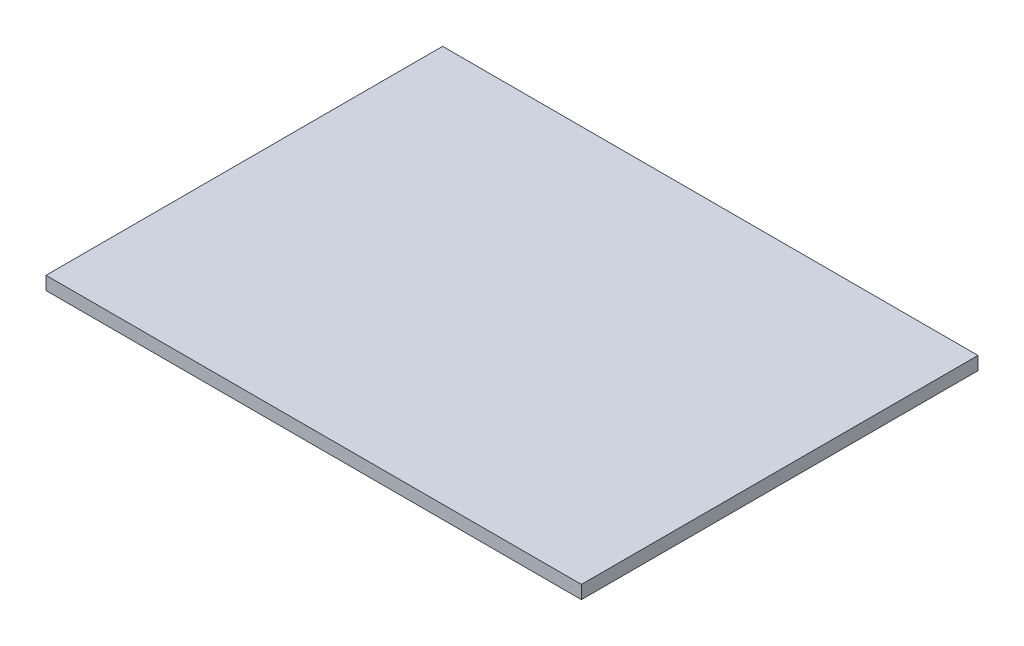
ISO-10303-21;
HEADER;
FILE_DESCRIPTION(('STEP AP214'),'2;1');
FILE_NAME('part.step','',(''),(''),'','','');
FILE_SCHEMA(('AUTOMOTIVE_DESIGN { 1 0 10303 214 1 1 1 1 }'));
ENDSEC;
DATA;
#1=APPLICATION_CONTEXT('core data for automotive mechanical design processes');
#2=APPLICATION_PROTOCOL_DEFINITION('international standard','automotive_design',2000,#1);
#3=PRODUCT_CONTEXT('',#1,'mechanical');
#4=PRODUCT('Part','Part','',(#3));
#5=PRODUCT_RELATED_PRODUCT_CATEGORY('part','',(#4));
#6=PRODUCT_DEFINITION_FORMATION('','',#4);
#7=PRODUCT_DEFINITION_CONTEXT('part definition',#1,'design');
#8=PRODUCT_DEFINITION('design','',#6,#7);
#9=PRODUCT_DEFINITION_SHAPE('','',#8);
#10=(LENGTH_UNIT() NAMED_UNIT(*) SI_UNIT(.MILLI.,.METRE.));
#11=(NAMED_UNIT(*) PLANE_ANGLE_UNIT() SI_UNIT($,.RADIAN.));
#12=(NAMED_UNIT(*) SI_UNIT($,.STERADIAN.) SOLID_ANGLE_UNIT());
#13=UNCERTAINTY_MEASURE_WITH_UNIT(LENGTH_MEASURE(1.E-05),#10,'distance_accuracy_value','');
#14=(GEOMETRIC_REPRESENTATION_CONTEXT(3) GLOBAL_UNCERTAINTY_ASSIGNED_CONTEXT((#13)) GLOBAL_UNIT_ASSIGNED_CONTEXT((#10,
#11,#12)) REPRESENTATION_CONTEXT('',''));
#15=CARTESIAN_POINT('',(0.,0.,0.));
#16=DIRECTION('',(0.,0.,1.));
#17=DIRECTION('',(1.,0.,0.));
#18=AXIS2_PLACEMENT_3D('',#15,#16,#17);
#19=CARTESIAN_POINT('',(20.25,0.5,15.));
#20=DIRECTION('',(-1.,0.,0.));
#21=DIRECTION('',(0.,0.,1.));
#22=AXIS2_PLACEMENT_3D('',#19,#20,#21);
#23=PLANE('',#22);
#24=DIRECTION('',(0.,0.,-1.));
#25=VECTOR('',#24,1.);
#26=CARTESIAN_POINT('',(20.25,-0.5,15.));
#27=LINE('',#26,#25);
#28=CARTESIAN_POINT('',(20.25,-0.5,15.));
#29=VERTEX_POINT('',#28);
#30=CARTESIAN_POINT('',(20.25,-0.5,-15.));
#31=VERTEX_POINT('',#30);
#32=EDGE_CURVE('E99',#29,#31,#27,.T.);
#33=ORIENTED_EDGE('',*,*,#32,.T.);
#34=DIRECTION('',(0.,-1.,0.));
#35=VECTOR('',#34,1.);
#36=CARTESIAN_POINT('',(20.25,0.5,-15.));
#37=LINE('',#36,#35);
#38=CARTESIAN_POINT('',(20.25,0.5,-15.));
#39=VERTEX_POINT('',#38);
#40=EDGE_CURVE('E11',#39,#31,#37,.T.);
#41=ORIENTED_EDGE('',*,*,#40,.F.);
#42=DIRECTION('',(0.,0.,-1.));
#43=VECTOR('',#42,1.);
#44=CARTESIAN_POINT('',(20.25,0.5,15.));
#45=LINE('',#44,#43);
#46=CARTESIAN_POINT('',(20.25,0.5,15.));
#47=VERTEX_POINT('',#46);
#48=EDGE_CURVE('E87',#47,#39,#45,.T.);
#49=ORIENTED_EDGE('',*,*,#48,.F.);
#50=DIRECTION('',(0.,-1.,0.));
#51=VECTOR('',#50,1.);
#52=CARTESIAN_POINT('',(20.25,0.5,15.));
#53=LINE('',#52,#51);
#54=EDGE_CURVE('E95',#47,#29,#53,.T.);
#55=ORIENTED_EDGE('',*,*,#54,.T.);
#56=EDGE_LOOP('',(#33,#41,#49,#55));
#57=FACE_BOUND('',#56,.T.);
#58=ADVANCED_FACE('F36',(#57),#23,.F.);
#59=CARTESIAN_POINT('',(-20.25,0.5,-15.));
#60=DIRECTION('',(0.,0.,1.));
#61=DIRECTION('',(1.,0.,0.));
#62=AXIS2_PLACEMENT_3D('',#59,#60,#61);
#63=PLANE('',#62);
#64=DIRECTION('',(-1.,0.,0.));
#65=VECTOR('',#64,1.);
#66=CARTESIAN_POINT('',(-20.25,-0.5,-15.));
#67=LINE('',#66,#65);
#68=CARTESIAN_POINT('',(-20.25,-0.5,-15.));
#69=VERTEX_POINT('',#68);
#70=EDGE_CURVE('E91',#31,#69,#67,.T.);
#71=ORIENTED_EDGE('',*,*,#70,.T.);
#72=DIRECTION('',(0.,-1.,0.));
#73=VECTOR('',#72,1.);
#74=CARTESIAN_POINT('',(-20.25,0.5,-15.));
#75=LINE('',#74,#73);
#76=CARTESIAN_POINT('',(-20.25,0.5,-15.));
#77=VERTEX_POINT('',#76);
#78=EDGE_CURVE('E44',#77,#69,#75,.T.);
#79=ORIENTED_EDGE('',*,*,#78,.F.);
#80=DIRECTION('',(-1.,0.,0.));
#81=VECTOR('',#80,1.);
#82=CARTESIAN_POINT('',(-20.25,0.5,-15.));
#83=LINE('',#82,#81);
#84=EDGE_CURVE('E82',#39,#77,#83,.T.);
#85=ORIENTED_EDGE('',*,*,#84,.F.);
#86=ORIENTED_EDGE('',*,*,#40,.T.);
#87=EDGE_LOOP('',(#71,#79,#85,#86));
#88=FACE_BOUND('',#87,.T.);
#89=ADVANCED_FACE('F90',(#88),#63,.F.);
#90=CARTESIAN_POINT('',(-20.25,0.5,15.));
#91=DIRECTION('',(1.,0.,0.));
#92=DIRECTION('',(0.,0.,-1.));
#93=AXIS2_PLACEMENT_3D('',#90,#91,#92);
#94=PLANE('',#93);
#95=DIRECTION('',(0.,0.,1.));
#96=VECTOR('',#95,1.);
#97=CARTESIAN_POINT('',(-20.25,-0.5,15.));
#98=LINE('',#97,#96);
#99=CARTESIAN_POINT('',(-20.25,-0.5,15.));
#100=VERTEX_POINT('',#99);
#101=EDGE_CURVE('E69',#69,#100,#98,.T.);
#102=ORIENTED_EDGE('',*,*,#101,.T.);
#103=DIRECTION('',(0.,-1.,0.));
#104=VECTOR('',#103,1.);
#105=CARTESIAN_POINT('',(-20.25,0.5,15.));
#106=LINE('',#105,#104);
#107=CARTESIAN_POINT('',(-20.25,0.5,15.));
#108=VERTEX_POINT('',#107);
#109=EDGE_CURVE('E92',#108,#100,#106,.T.);
#110=ORIENTED_EDGE('',*,*,#109,.F.);
#111=DIRECTION('',(0.,0.,1.));
#112=VECTOR('',#111,1.);
#113=CARTESIAN_POINT('',(-20.25,0.5,15.));
#114=LINE('',#113,#112);
#115=EDGE_CURVE('E85',#77,#108,#114,.T.);
#116=ORIENTED_EDGE('',*,*,#115,.F.);
#117=ORIENTED_EDGE('',*,*,#78,.T.);
#118=EDGE_LOOP('',(#102,#110,#116,#117));
#119=FACE_BOUND('',#118,.T.);
#120=ADVANCED_FACE('F93',(#119),#94,.F.);
#121=CARTESIAN_POINT('',(-20.25,0.5,15.));
#122=DIRECTION('',(0.,0.,-1.));
#123=DIRECTION('',(-1.,0.,0.));
#124=AXIS2_PLACEMENT_3D('',#121,#122,#123);
#125=PLANE('',#124);
#126=DIRECTION('',(1.,0.,0.));
#127=VECTOR('',#126,1.);
#128=CARTESIAN_POINT('',(-20.25,-0.5,15.));
#129=LINE('',#128,#127);
#130=EDGE_CURVE('E75',#100,#29,#129,.T.);
#131=ORIENTED_EDGE('',*,*,#130,.T.);
#132=ORIENTED_EDGE('',*,*,#54,.F.);
#133=DIRECTION('',(1.,0.,0.));
#134=VECTOR('',#133,1.);
#135=CARTESIAN_POINT('',(-20.25,0.5,15.));
#136=LINE('',#135,#134);
#137=EDGE_CURVE('E52',#108,#47,#136,.T.);
#138=ORIENTED_EDGE('',*,*,#137,.F.);
#139=ORIENTED_EDGE('',*,*,#109,.T.);
#140=EDGE_LOOP('',(#131,#132,#138,#139));
#141=FACE_BOUND('',#140,.T.);
#142=ADVANCED_FACE('F106',(#141),#125,.F.);
#143=CARTESIAN_POINT('',(0.,0.5,0.));
#144=DIRECTION('',(0.,-1.,0.));
#145=DIRECTION('',(0.,0.,-1.));
#146=AXIS2_PLACEMENT_3D('',#143,#144,#145);
#147=PLANE('',#146);
#148=ORIENTED_EDGE('',*,*,#48,.T.);
#149=ORIENTED_EDGE('',*,*,#84,.T.);
#150=ORIENTED_EDGE('',*,*,#115,.T.);
#151=ORIENTED_EDGE('',*,*,#137,.T.);
#152=EDGE_LOOP('',(#148,#149,#150,#151));
#153=FACE_BOUND('',#152,.T.);
#154=ADVANCED_FACE('F83',(#153),#147,.F.);
#155=CARTESIAN_POINT('',(0.,-0.5,0.));
#156=DIRECTION('',(0.,-1.,0.));
#157=DIRECTION('',(0.,0.,-1.));
#158=AXIS2_PLACEMENT_3D('',#155,#156,#157);
#159=PLANE('',#158);
#160=ORIENTED_EDGE('',*,*,#32,.F.);
#161=ORIENTED_EDGE('',*,*,#130,.F.);
#162=ORIENTED_EDGE('',*,*,#101,.F.);
#163=ORIENTED_EDGE('',*,*,#70,.F.);
#164=EDGE_LOOP('',(#160,#161,#162,#163));
#165=FACE_BOUND('',#164,.T.);
#166=ADVANCED_FACE('F109',(#165),#159,.T.);
#167=CLOSED_SHELL('',(#58,#89,#120,#142,#154,#166));
#168=MANIFOLD_SOLID_BREP('B2',#167);
#169=ADVANCED_BREP_SHAPE_REPRESENTATION('',(#18,#168),#14);
#170=SHAPE_DEFINITION_REPRESENTATION(#9,#169);
ENDSEC;
END-ISO-10303-21;
